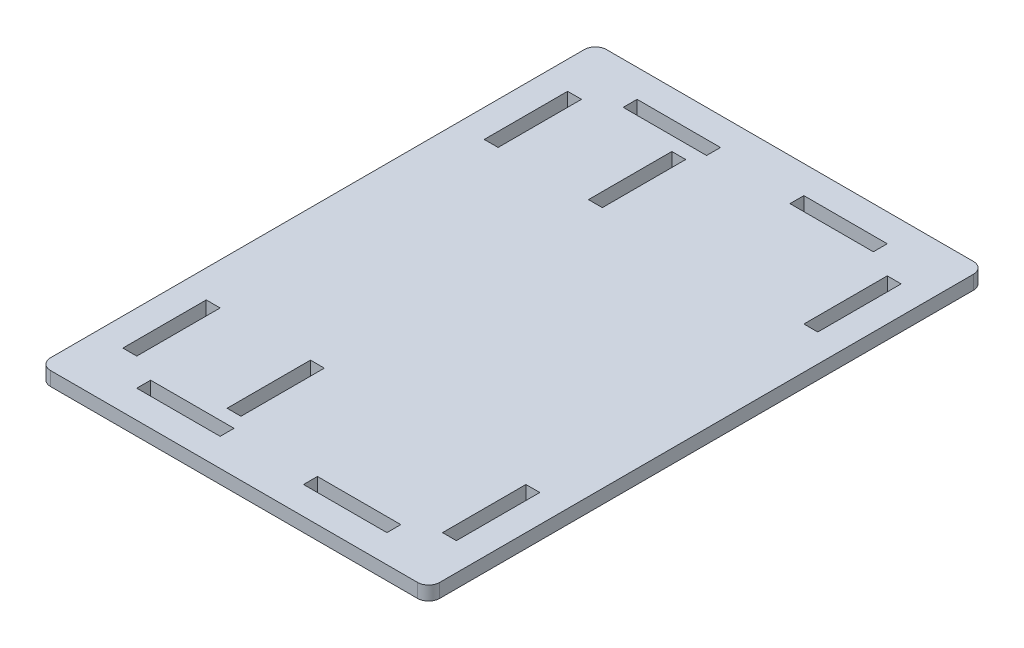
from build123d import *

# Parameters (mm, degrees)
SKETCH1_W           = 88.9
SKETCH1_H           = 127
BOSS_EXTRUDE1_DEPTH = 3.175
SKETCH2_W           = 3.175
SKETCH2_H           = 19.05
SKETCH2_W_2         = 19.05
SKETCH2_H_2         = 3.175
CUT_EXTRUDE1_DEPTH  = 156.055766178
FILLET1_R           = 2.54


with BuildPart() as part:
    # Sketch1 → Boss-Extrude1 (new body)
    with BuildSketch(Plane(origin=(0, 0, 0), x_dir=(1, 0, 0), z_dir=(0, 1, 0))):
        with Locations((44.45, 63.5)):
            Rectangle(SKETCH1_W, SKETCH1_H)
    extrude(amount=BOSS_EXTRUDE1_DEPTH)

    # Sketch2 → Cut-Extrude1 (cut, through all)
    with BuildSketch(Plane(origin=(0, 3.175, 0), x_dir=(1, 0, 0), z_dir=(0, 1, 0))):
        with Locations((7.9375, 104.775)):
            Rectangle(SKETCH2_W, SKETCH2_H)
        with Locations((80.9625, 104.775)):
            Rectangle(SKETCH2_W, SKETCH2_H)
        with Locations((80.9625, 22.225)):
            Rectangle(SKETCH2_W, SKETCH2_H)
        with Locations((7.9375, 22.225)):
            Rectangle(SKETCH2_W, SKETCH2_H)
        with Locations((63.5, 119.0625)):
            Rectangle(SKETCH2_W_2, SKETCH2_H_2)
        with Locations((25.4, 119.0625)):
            Rectangle(SKETCH2_W_2, SKETCH2_H_2)
        with Locations((63.5, 7.9375)):
            Rectangle(SKETCH2_W_2, SKETCH2_H_2)
        with Locations((25.4, 7.9375)):
            Rectangle(SKETCH2_W_2, SKETCH2_H_2)
        with Locations((31.75, 22.225)):
            Rectangle(SKETCH2_W, SKETCH2_H)
        with Locations((31.75, 104.775)):
            Rectangle(SKETCH2_W, SKETCH2_H)
    extrude(amount=-CUT_EXTRUDE1_DEPTH, mode=Mode.SUBTRACT)

    # Fillet1
    fillet1_edges = [part.edges().sort_by_distance(p)[0] for p in [
        (0, 1.5875, -127),
        (88.9, 1.5875, -127),
        (88.9, 1.5875, 0),
        (0, 1.5875, 0),
    ]]
    fillet(fillet1_edges, radius=FILLET1_R)


solid = part.part
